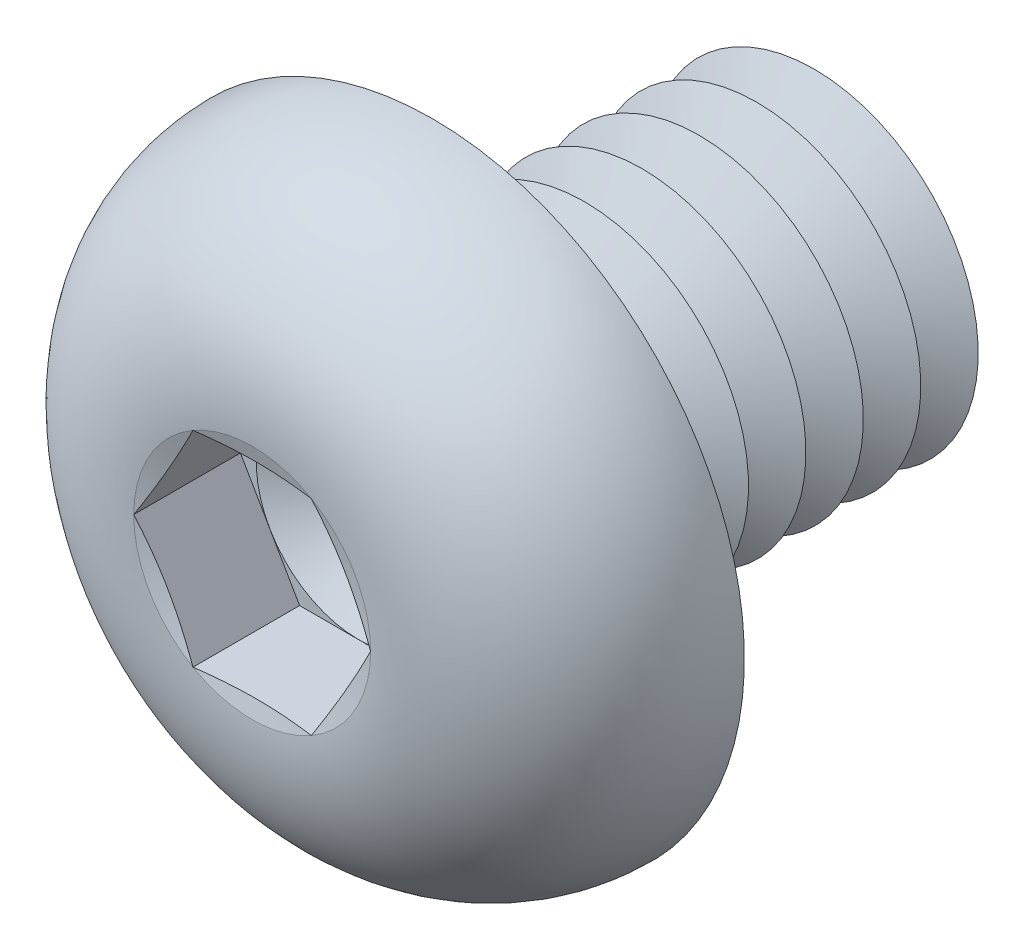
ISO-10303-21;
HEADER;
FILE_DESCRIPTION(('STEP AP214'),'2;1');
FILE_NAME('part.step','',(''),(''),'','','');
FILE_SCHEMA(('AUTOMOTIVE_DESIGN { 1 0 10303 214 1 1 1 1 }'));
ENDSEC;
DATA;
#1=APPLICATION_CONTEXT('core data for automotive mechanical design processes');
#2=APPLICATION_PROTOCOL_DEFINITION('international standard','automotive_design',2000,#1);
#3=PRODUCT_CONTEXT('',#1,'mechanical');
#4=PRODUCT('Part','Part','',(#3));
#5=PRODUCT_RELATED_PRODUCT_CATEGORY('part','',(#4));
#6=PRODUCT_DEFINITION_FORMATION('','',#4);
#7=PRODUCT_DEFINITION_CONTEXT('part definition',#1,'design');
#8=PRODUCT_DEFINITION('design','',#6,#7);
#9=PRODUCT_DEFINITION_SHAPE('','',#8);
#10=(LENGTH_UNIT() NAMED_UNIT(*) SI_UNIT(.MILLI.,.METRE.));
#11=(NAMED_UNIT(*) PLANE_ANGLE_UNIT() SI_UNIT($,.RADIAN.));
#12=(NAMED_UNIT(*) SI_UNIT($,.STERADIAN.) SOLID_ANGLE_UNIT());
#13=UNCERTAINTY_MEASURE_WITH_UNIT(LENGTH_MEASURE(1.E-05),#10,'distance_accuracy_value','');
#14=(GEOMETRIC_REPRESENTATION_CONTEXT(3) GLOBAL_UNCERTAINTY_ASSIGNED_CONTEXT((#13)) GLOBAL_UNIT_ASSIGNED_CONTEXT((#10,
#11,#12)) REPRESENTATION_CONTEXT('',''));
#15=CARTESIAN_POINT('',(0.,0.,0.));
#16=DIRECTION('',(0.,0.,1.));
#17=DIRECTION('',(1.,0.,0.));
#18=AXIS2_PLACEMENT_3D('',#15,#16,#17);
#19=CARTESIAN_POINT('',(0.,0.,0.9));
#20=DIRECTION('',(0.,0.,1.));
#21=DIRECTION('',(1.,0.,0.));
#22=AXIS2_PLACEMENT_3D('',#19,#20,#21);
#23=PLANE('',#22);
#24=CARTESIAN_POINT('',(0.,0.,0.9));
#25=DIRECTION('',(0.,0.,1.));
#26=DIRECTION('',(1.,0.,0.));
#27=AXIS2_PLACEMENT_3D('',#24,#25,#26);
#28=CIRCLE('',#27,1.24999941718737);
#29=CARTESIAN_POINT('',(1.08253125,0.624999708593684,0.9));
#30=VERTEX_POINT('',#29);
#31=CARTESIAN_POINT('',(0.,1.24999941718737,0.9));
#32=VERTEX_POINT('',#31);
#33=EDGE_CURVE('E118',#30,#32,#28,.T.);
#34=ORIENTED_EDGE('',*,*,#33,.F.);
#35=DIRECTION('',(-0.5,0.866025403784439,0.));
#36=VECTOR('',#35,1.);
#37=CARTESIAN_POINT('',(1.44337500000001,0.,0.9));
#38=LINE('',#37,#36);
#39=CARTESIAN_POINT('',(0.721687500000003,1.24999941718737,0.9));
#40=VERTEX_POINT('',#39);
#41=EDGE_CURVE('E125',#30,#40,#38,.T.);
#42=ORIENTED_EDGE('',*,*,#41,.T.);
#43=DIRECTION('',(-1.,0.,0.));
#44=VECTOR('',#43,1.);
#45=CARTESIAN_POINT('',(0.721687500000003,1.24999941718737,0.9));
#46=LINE('',#45,#44);
#47=EDGE_CURVE('E136',#40,#32,#46,.T.);
#48=ORIENTED_EDGE('',*,*,#47,.T.);
#49=EDGE_LOOP('',(#34,#42,#48));
#50=FACE_BOUND('',#49,.T.);
#51=ADVANCED_FACE('F39',(#50),#23,.T.);
#52=CARTESIAN_POINT('',(0.,0.,0.9));
#53=DIRECTION('',(0.,0.,1.));
#54=DIRECTION('',(1.,0.,0.));
#55=AXIS2_PLACEMENT_3D('',#52,#53,#54);
#56=CIRCLE('',#55,1.24999941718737);
#57=CARTESIAN_POINT('',(-1.08253125,0.624999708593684,0.9));
#58=VERTEX_POINT('',#57);
#59=EDGE_CURVE('E11',#32,#58,#56,.T.);
#60=ORIENTED_EDGE('',*,*,#59,.F.);
#61=CARTESIAN_POINT('',(-0.721687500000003,1.24999941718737,0.9));
#62=VERTEX_POINT('',#61);
#63=EDGE_CURVE('E131',#32,#62,#46,.T.);
#64=ORIENTED_EDGE('',*,*,#63,.T.);
#65=DIRECTION('',(-0.5,-0.866025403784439,0.));
#66=VECTOR('',#65,1.);
#67=CARTESIAN_POINT('',(-0.721687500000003,1.24999941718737,0.9));
#68=LINE('',#67,#66);
#69=EDGE_CURVE('E134',#62,#58,#68,.T.);
#70=ORIENTED_EDGE('',*,*,#69,.T.);
#71=EDGE_LOOP('',(#60,#64,#70));
#72=FACE_BOUND('',#71,.T.);
#73=ADVANCED_FACE('F130',(#72),#23,.T.);
#74=CARTESIAN_POINT('',(-1.08253125,-0.624999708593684,0.9));
#75=VERTEX_POINT('',#74);
#76=EDGE_CURVE('E49',#58,#75,#56,.T.);
#77=ORIENTED_EDGE('',*,*,#76,.F.);
#78=CARTESIAN_POINT('',(-1.44337500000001,0.,0.9));
#79=VERTEX_POINT('',#78);
#80=EDGE_CURVE('E143',#58,#79,#68,.T.);
#81=ORIENTED_EDGE('',*,*,#80,.T.);
#82=DIRECTION('',(0.5,-0.866025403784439,0.));
#83=VECTOR('',#82,1.);
#84=CARTESIAN_POINT('',(-1.44337500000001,0.,0.9));
#85=LINE('',#84,#83);
#86=EDGE_CURVE('E152',#79,#75,#85,.T.);
#87=ORIENTED_EDGE('',*,*,#86,.T.);
#88=EDGE_LOOP('',(#77,#81,#87));
#89=FACE_BOUND('',#88,.T.);
#90=ADVANCED_FACE('F329',(#89),#23,.T.);
#91=CARTESIAN_POINT('',(0.,-1.24999941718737,0.9));
#92=VERTEX_POINT('',#91);
#93=EDGE_CURVE('E314',#75,#92,#56,.T.);
#94=ORIENTED_EDGE('',*,*,#93,.F.);
#95=CARTESIAN_POINT('',(-0.721687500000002,-1.24999941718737,0.9));
#96=VERTEX_POINT('',#95);
#97=EDGE_CURVE('E151',#75,#96,#85,.T.);
#98=ORIENTED_EDGE('',*,*,#97,.T.);
#99=DIRECTION('',(1.,0.,0.));
#100=VECTOR('',#99,1.);
#101=CARTESIAN_POINT('',(-0.721687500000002,-1.24999941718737,0.9));
#102=LINE('',#101,#100);
#103=EDGE_CURVE('E157',#96,#92,#102,.T.);
#104=ORIENTED_EDGE('',*,*,#103,.T.);
#105=EDGE_LOOP('',(#94,#98,#104));
#106=FACE_BOUND('',#105,.T.);
#107=ADVANCED_FACE('F322',(#106),#23,.T.);
#108=CARTESIAN_POINT('',(1.08253125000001,-0.624999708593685,0.9));
#109=VERTEX_POINT('',#108);
#110=EDGE_CURVE('E56',#92,#109,#56,.T.);
#111=ORIENTED_EDGE('',*,*,#110,.F.);
#112=CARTESIAN_POINT('',(0.721687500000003,-1.24999941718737,0.9));
#113=VERTEX_POINT('',#112);
#114=EDGE_CURVE('E156',#92,#113,#102,.T.);
#115=ORIENTED_EDGE('',*,*,#114,.T.);
#116=DIRECTION('',(0.5,0.866025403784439,0.));
#117=VECTOR('',#116,1.);
#118=CARTESIAN_POINT('',(0.721687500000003,-1.24999941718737,0.9));
#119=LINE('',#118,#117);
#120=EDGE_CURVE('E162',#113,#109,#119,.T.);
#121=ORIENTED_EDGE('',*,*,#120,.T.);
#122=EDGE_LOOP('',(#111,#115,#121));
#123=FACE_BOUND('',#122,.T.);
#124=ADVANCED_FACE('F400',(#123),#23,.T.);
#125=CARTESIAN_POINT('',(0.,0.,2.2));
#126=DIRECTION('',(0.,0.,1.));
#127=DIRECTION('',(0.,-1.,0.));
#128=AXIS2_PLACEMENT_3D('',#125,#126,#127);
#129=CONICAL_SURFACE('',#128,1.44337500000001,1.30899693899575);
#130=CARTESIAN_POINT('',(1.44349047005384,-0.000200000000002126,2.20003094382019));
#131=CARTESIAN_POINT('',(1.41351104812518,0.0517258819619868,2.19199301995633));
#132=CARTESIAN_POINT('',(1.38347725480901,0.103745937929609,2.18469579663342));
#133=CARTESIAN_POINT('',(1.32330355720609,0.20796983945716,2.17187512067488));
#134=CARTESIAN_POINT('',(1.29316361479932,0.260173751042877,2.16635238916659));
#135=CARTESIAN_POINT('',(1.23296043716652,0.364448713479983,2.15740323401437));
#136=CARTESIAN_POINT('',(1.20289760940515,0.416519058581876,2.15396613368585));
#137=CARTESIAN_POINT('',(1.14273359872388,0.520726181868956,2.14935732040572));
#138=CARTESIAN_POINT('',(1.11263242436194,0.572862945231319,2.14818516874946));
#139=CARTESIAN_POINT('',(1.05243007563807,0.677136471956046,2.14818516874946));
#140=CARTESIAN_POINT('',(1.02232890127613,0.729273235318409,2.14935732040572));
#141=CARTESIAN_POINT('',(0.96216489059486,0.833480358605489,2.15396613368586));
#142=CARTESIAN_POINT('',(0.932102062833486,0.885550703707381,2.15740323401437));
#143=CARTESIAN_POINT('',(0.871898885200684,0.989825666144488,2.16635238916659));
#144=CARTESIAN_POINT('',(0.841758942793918,1.04202957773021,2.17187512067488));
#145=CARTESIAN_POINT('',(0.781585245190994,1.14625347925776,2.18469579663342));
#146=CARTESIAN_POINT('',(0.751551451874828,1.19827353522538,2.19199301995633));
#147=CARTESIAN_POINT('',(0.721572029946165,1.25019941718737,2.20003094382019));
#148=B_SPLINE_CURVE_WITH_KNOTS('',3,(#130,#131,#132,#133,#134,#135,#136,#137,#138,#139,#140,
#141,#142,#143,#144,#145,#146,#147),.UNSPECIFIED.,.F.,.F.,(4,2,2,2,2,2,2,2,4),(0.,
0.181495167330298,0.363063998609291,0.543695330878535,0.724291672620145,0.904888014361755,
1.085519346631,1.26708817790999,1.44858334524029),.UNSPECIFIED.);
#149=CARTESIAN_POINT('',(1.44337500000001,0.,2.2));
#150=VERTEX_POINT('',#149);
#151=CARTESIAN_POINT('',(0.721687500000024,1.24999941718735,2.2));
#152=VERTEX_POINT('',#151);
#153=EDGE_CURVE('E222',#150,#152,#148,.T.);
#154=ORIENTED_EDGE('',*,*,#153,.F.);
#155=CARTESIAN_POINT('',(0.,0.,2.2));
#156=DIRECTION('',(0.,0.,-1.));
#157=DIRECTION('',(0.,1.,0.));
#158=AXIS2_PLACEMENT_3D('',#155,#156,#157);
#159=CIRCLE('',#158,1.44337500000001);
#160=EDGE_CURVE('E294',#152,#150,#159,.T.);
#161=ORIENTED_EDGE('',*,*,#160,.F.);
#162=EDGE_LOOP('',(#154,#161));
#163=FACE_BOUND('',#162,.T.);
#164=ADVANCED_FACE('F404',(#163),#129,.F.);
#165=CARTESIAN_POINT('',(0.721572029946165,-1.25019941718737,2.20003094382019));
#166=CARTESIAN_POINT('',(0.751551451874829,-1.19827353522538,2.19199301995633));
#167=CARTESIAN_POINT('',(0.781585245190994,-1.14625347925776,2.18469579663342));
#168=CARTESIAN_POINT('',(0.841758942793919,-1.04202957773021,2.17187512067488));
#169=CARTESIAN_POINT('',(0.871898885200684,-0.989825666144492,2.16635238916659));
#170=CARTESIAN_POINT('',(0.932102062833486,-0.885550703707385,2.15740323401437));
#171=CARTESIAN_POINT('',(0.96216489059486,-0.833480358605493,2.15396613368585));
#172=CARTESIAN_POINT('',(1.02232890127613,-0.729273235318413,2.14935732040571));
#173=CARTESIAN_POINT('',(1.05243007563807,-0.67713647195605,2.14818516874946));
#174=CARTESIAN_POINT('',(1.11263242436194,-0.572862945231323,2.14818516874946));
#175=CARTESIAN_POINT('',(1.14273359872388,-0.52072618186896,2.14935732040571));
#176=CARTESIAN_POINT('',(1.20289760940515,-0.41651905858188,2.15396613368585));
#177=CARTESIAN_POINT('',(1.23296043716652,-0.364448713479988,2.15740323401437));
#178=CARTESIAN_POINT('',(1.29316361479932,-0.260173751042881,2.16635238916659));
#179=CARTESIAN_POINT('',(1.32330355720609,-0.207969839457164,2.17187512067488));
#180=CARTESIAN_POINT('',(1.38347725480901,-0.103745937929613,2.18469579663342));
#181=CARTESIAN_POINT('',(1.41351104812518,-0.0517258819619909,2.19199301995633));
#182=CARTESIAN_POINT('',(1.44349047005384,0.000199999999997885,2.20003094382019));
#183=B_SPLINE_CURVE_WITH_KNOTS('',3,(#165,#166,#167,#168,#169,#170,#171,#172,#173,#174,#175,
#176,#177,#178,#179,#180,#181,#182),.UNSPECIFIED.,.F.,.F.,(4,2,2,2,2,2,2,2,4),(0.,
0.181495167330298,0.363063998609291,0.543695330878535,0.724291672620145,0.904888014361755,
1.085519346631,1.26708817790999,1.44858334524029),.UNSPECIFIED.);
#184=CARTESIAN_POINT('',(0.721687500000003,-1.24999941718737,2.2));
#185=VERTEX_POINT('',#184);
#186=EDGE_CURVE('E231',#185,#150,#183,.T.);
#187=ORIENTED_EDGE('',*,*,#186,.F.);
#188=EDGE_CURVE('E299',#150,#185,#159,.T.);
#189=ORIENTED_EDGE('',*,*,#188,.F.);
#190=EDGE_LOOP('',(#187,#189));
#191=FACE_BOUND('',#190,.T.);
#192=ADVANCED_FACE('F365',(#191),#129,.F.);
#193=CARTESIAN_POINT('',(-2.17815859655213,-1.24999941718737,2.48616275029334));
#194=CARTESIAN_POINT('',(-2.07269794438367,-1.24999941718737,2.46168811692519));
#195=CARTESIAN_POINT('',(-1.967149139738,-1.24999941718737,2.43756889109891));
#196=CARTESIAN_POINT('',(-1.75576352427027,-1.24999941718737,2.39052699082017));
#197=CARTESIAN_POINT('',(-1.64992665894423,-1.24999941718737,2.36760456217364));
#198=CARTESIAN_POINT('',(-1.43690237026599,-1.24999941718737,2.3232454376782));
#199=CARTESIAN_POINT('',(-1.32971158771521,-1.24999941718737,2.30182468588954));
#200=CARTESIAN_POINT('',(-1.1148274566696,-1.24999941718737,2.26156703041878));
#201=CARTESIAN_POINT('',(-1.00713406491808,-1.24999941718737,2.24273035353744));
#202=CARTESIAN_POINT('',(-0.794044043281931,-1.24999941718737,2.2093913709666));
#203=CARTESIAN_POINT('',(-0.688664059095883,-1.24999941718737,2.19478562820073));
#204=CARTESIAN_POINT('',(-0.477310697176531,-1.24999941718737,2.17085809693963));
#205=CARTESIAN_POINT('',(-0.371337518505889,-1.24999941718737,2.16153463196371));
#206=CARTESIAN_POINT('',(-0.159455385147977,-1.24999941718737,2.14976770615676));
#207=CARTESIAN_POINT('',(-0.0535482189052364,-1.24999941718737,2.14729400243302));
#208=CARTESIAN_POINT('',(0.15818919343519,-1.24999941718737,2.14966287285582));
#209=CARTESIAN_POINT('',(0.264019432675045,-1.24999941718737,2.15450603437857));
#210=CARTESIAN_POINT('',(0.445148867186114,-1.24999941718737,2.16825380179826));
#211=CARTESIAN_POINT('',(0.520574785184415,-1.24999941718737,2.17561242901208));
#212=CARTESIAN_POINT('',(0.671115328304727,-1.24999941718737,2.19297000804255));
#213=CARTESIAN_POINT('',(0.746229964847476,-1.24999941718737,2.20296886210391));
#214=CARTESIAN_POINT('',(0.89638731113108,-1.24999941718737,2.22505910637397));
#215=CARTESIAN_POINT('',(0.97142904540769,-1.24999941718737,2.23715700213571));
#216=CARTESIAN_POINT('',(1.12124320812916,-1.24999941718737,2.26292371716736));
#217=CARTESIAN_POINT('',(1.19601562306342,-1.24999941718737,2.27659261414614));
#218=CARTESIAN_POINT('',(1.34686913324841,-1.24999941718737,2.30540811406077));
#219=CARTESIAN_POINT('',(1.42294548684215,-1.24999941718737,2.320579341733));
#220=CARTESIAN_POINT('',(1.57490676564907,-1.24999941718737,2.351851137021));
#221=CARTESIAN_POINT('',(1.65079168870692,-1.24999941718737,2.36795171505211));
#222=CARTESIAN_POINT('',(1.80199501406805,-1.24999941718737,2.40076814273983));
#223=CARTESIAN_POINT('',(1.8773142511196,-1.24999941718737,2.41748016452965));
#224=CARTESIAN_POINT('',(2.02782424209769,-1.24999941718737,2.45144971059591));
#225=CARTESIAN_POINT('',(2.10301500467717,-1.24999941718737,2.46870719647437));
#226=CARTESIAN_POINT('',(2.17815859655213,-1.24999941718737,2.48616275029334));
#227=B_SPLINE_CURVE_WITH_KNOTS('',3,(#193,#194,#195,#196,#197,#198,#199,#200,#201,#202,#203,
#204,#205,#206,#207,#208,#209,#210,#211,#212,#213,#214,#215,#216,#217,#218,#219,#220,#221,#222,
#223,#224,#225,#226),.UNSPECIFIED.,.F.,.F.,(4,2,2,2,2,2,2,2,2,2,2,2,2,2,2,2,4),(0.,
0.324797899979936,0.649662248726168,0.977572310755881,1.30551113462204,1.62458166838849,
1.94355087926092,2.26110952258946,2.5786936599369,2.80599541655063,3.03328875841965,
3.26129956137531,3.48932164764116,3.72203713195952,3.954755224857,4.18620606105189,
4.41764064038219),.UNSPECIFIED.);
#228=CARTESIAN_POINT('',(-0.721687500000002,-1.24999941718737,2.2));
#229=VERTEX_POINT('',#228);
#230=EDGE_CURVE('E342',#229,#185,#227,.T.);
#231=ORIENTED_EDGE('',*,*,#230,.F.);
#232=EDGE_CURVE('E355',#185,#229,#159,.T.);
#233=ORIENTED_EDGE('',*,*,#232,.F.);
#234=EDGE_LOOP('',(#231,#233));
#235=FACE_BOUND('',#234,.T.);
#236=ADVANCED_FACE('F370',(#235),#129,.F.);
#237=CARTESIAN_POINT('',(-1.44349047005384,0.000199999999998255,2.20003094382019));
#238=CARTESIAN_POINT('',(-1.41351104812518,-0.0517258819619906,2.19199301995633));
#239=CARTESIAN_POINT('',(-1.38347725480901,-0.103745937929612,2.18469579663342));
#240=CARTESIAN_POINT('',(-1.32330355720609,-0.207969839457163,2.17187512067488));
#241=CARTESIAN_POINT('',(-1.29316361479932,-0.260173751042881,2.16635238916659));
#242=CARTESIAN_POINT('',(-1.23296043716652,-0.364448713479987,2.15740323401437));
#243=CARTESIAN_POINT('',(-1.20289760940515,-0.41651905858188,2.15396613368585));
#244=CARTESIAN_POINT('',(-1.14273359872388,-0.52072618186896,2.14935732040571));
#245=CARTESIAN_POINT('',(-1.11263242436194,-0.572862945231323,2.14818516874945));
#246=CARTESIAN_POINT('',(-1.05243007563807,-0.67713647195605,2.14818516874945));
#247=CARTESIAN_POINT('',(-1.02232890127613,-0.729273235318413,2.14935732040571));
#248=CARTESIAN_POINT('',(-0.962164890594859,-0.833480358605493,2.15396613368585));
#249=CARTESIAN_POINT('',(-0.932102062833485,-0.885550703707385,2.15740323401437));
#250=CARTESIAN_POINT('',(-0.871898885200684,-0.989825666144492,2.16635238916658));
#251=CARTESIAN_POINT('',(-0.841758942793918,-1.04202957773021,2.17187512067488));
#252=CARTESIAN_POINT('',(-0.781585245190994,-1.14625347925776,2.18469579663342));
#253=CARTESIAN_POINT('',(-0.751551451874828,-1.19827353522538,2.19199301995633));
#254=CARTESIAN_POINT('',(-0.721572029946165,-1.25019941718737,2.20003094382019));
#255=B_SPLINE_CURVE_WITH_KNOTS('',3,(#237,#238,#239,#240,#241,#242,#243,#244,#245,#246,#247,
#248,#249,#250,#251,#252,#253,#254),.UNSPECIFIED.,.F.,.F.,(4,2,2,2,2,2,2,2,4),(0.,
0.181495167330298,0.363063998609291,0.543695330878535,0.724291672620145,0.904888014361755,
1.085519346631,1.26708817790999,1.44858334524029),.UNSPECIFIED.);
#256=CARTESIAN_POINT('',(-1.44337500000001,0.,2.2));
#257=VERTEX_POINT('',#256);
#258=EDGE_CURVE('E334',#257,#229,#255,.T.);
#259=ORIENTED_EDGE('',*,*,#258,.F.);
#260=EDGE_CURVE('E340',#229,#257,#159,.T.);
#261=ORIENTED_EDGE('',*,*,#260,.F.);
#262=EDGE_LOOP('',(#259,#261));
#263=FACE_BOUND('',#262,.T.);
#264=ADVANCED_FACE('F338',(#263),#129,.F.);
#265=CARTESIAN_POINT('',(-0.721572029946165,1.25019941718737,2.20003094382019));
#266=CARTESIAN_POINT('',(-0.751551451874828,1.19827353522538,2.19199301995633));
#267=CARTESIAN_POINT('',(-0.781585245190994,1.14625347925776,2.18469579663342));
#268=CARTESIAN_POINT('',(-0.841758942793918,1.04202957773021,2.17187512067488));
#269=CARTESIAN_POINT('',(-0.871898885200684,0.989825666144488,2.16635238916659));
#270=CARTESIAN_POINT('',(-0.932102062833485,0.885550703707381,2.15740323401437));
#271=CARTESIAN_POINT('',(-0.962164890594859,0.833480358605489,2.15396613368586));
#272=CARTESIAN_POINT('',(-1.02232890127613,0.729273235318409,2.14935732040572));
#273=CARTESIAN_POINT('',(-1.05243007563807,0.677136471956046,2.14818516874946));
#274=CARTESIAN_POINT('',(-1.11263242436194,0.57286294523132,2.14818516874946));
#275=CARTESIAN_POINT('',(-1.14273359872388,0.520726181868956,2.14935732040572));
#276=CARTESIAN_POINT('',(-1.20289760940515,0.416519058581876,2.15396613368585));
#277=CARTESIAN_POINT('',(-1.23296043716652,0.364448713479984,2.15740323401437));
#278=CARTESIAN_POINT('',(-1.29316361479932,0.260173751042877,2.16635238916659));
#279=CARTESIAN_POINT('',(-1.32330355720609,0.20796983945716,2.17187512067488));
#280=CARTESIAN_POINT('',(-1.38347725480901,0.103745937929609,2.18469579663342));
#281=CARTESIAN_POINT('',(-1.41351104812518,0.0517258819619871,2.19199301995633));
#282=CARTESIAN_POINT('',(-1.44349047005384,-0.000200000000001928,2.20003094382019));
#283=B_SPLINE_CURVE_WITH_KNOTS('',3,(#265,#266,#267,#268,#269,#270,#271,#272,#273,#274,#275,
#276,#277,#278,#279,#280,#281,#282),.UNSPECIFIED.,.F.,.F.,(4,2,2,2,2,2,2,2,4),(0.,
0.181495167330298,0.363063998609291,0.543695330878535,0.724291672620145,0.904888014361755,
1.085519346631,1.26708817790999,1.44858334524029),.UNSPECIFIED.);
#284=CARTESIAN_POINT('',(-0.721687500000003,1.24999941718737,2.2));
#285=VERTEX_POINT('',#284);
#286=EDGE_CURVE('E195',#285,#257,#283,.T.);
#287=ORIENTED_EDGE('',*,*,#286,.F.);
#288=EDGE_CURVE('E345',#257,#285,#159,.T.);
#289=ORIENTED_EDGE('',*,*,#288,.F.);
#290=EDGE_LOOP('',(#287,#289));
#291=FACE_BOUND('',#290,.T.);
#292=ADVANCED_FACE('F346',(#291),#129,.F.);
#293=CARTESIAN_POINT('',(0.,0.,-2.55));
#294=DIRECTION('',(0.,0.,1.));
#295=DIRECTION('',(0.,-1.,0.));
#296=AXIS2_PLACEMENT_3D('',#293,#294,#295);
#297=CONICAL_SURFACE('',#296,2.,1.0471975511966);
#298=CARTESIAN_POINT('',(0.,0.,-2.9));
#299=DIRECTION('',(0.,0.,1.));
#300=DIRECTION('',(0.,-1.,0.));
#301=AXIS2_PLACEMENT_3D('',#298,#299,#300);
#302=CIRCLE('',#301,1.39378221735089);
#303=CARTESIAN_POINT('',(0.,-1.39378221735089,-2.9));
#304=VERTEX_POINT('',#303);
#305=EDGE_CURVE('E265',#304,#304,#302,.T.);
#306=ORIENTED_EDGE('',*,*,#305,.T.);
#307=EDGE_LOOP('',(#306));
#308=FACE_BOUND('',#307,.T.);
#309=CARTESIAN_POINT('',(0.,0.,-2.55));
#310=DIRECTION('',(0.,0.,1.));
#311=DIRECTION('',(0.,-1.,0.));
#312=AXIS2_PLACEMENT_3D('',#309,#310,#311);
#313=CIRCLE('',#312,2.);
#314=CARTESIAN_POINT('',(0.,-2.,-2.55));
#315=VERTEX_POINT('',#314);
#316=EDGE_CURVE('E261',#315,#315,#313,.T.);
#317=ORIENTED_EDGE('',*,*,#316,.F.);
#318=EDGE_LOOP('',(#317));
#319=FACE_BOUND('',#318,.T.);
#320=ADVANCED_FACE('F430',(#308,#319),#297,.T.);
#321=CARTESIAN_POINT('',(0.,0.,-2.9));
#322=DIRECTION('',(0.,0.,-1.));
#323=DIRECTION('',(0.,1.,0.));
#324=AXIS2_PLACEMENT_3D('',#321,#322,#323);
#325=CONICAL_SURFACE('',#324,1.39378221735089,1.04719755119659);
#326=CARTESIAN_POINT('',(0.,0.,-3.25));
#327=DIRECTION('',(0.,0.,1.));
#328=DIRECTION('',(0.,-1.,0.));
#329=AXIS2_PLACEMENT_3D('',#326,#327,#328);
#330=CIRCLE('',#329,2.);
#331=CARTESIAN_POINT('',(0.,-2.,-3.25));
#332=VERTEX_POINT('',#331);
#333=EDGE_CURVE('E269',#332,#332,#330,.T.);
#334=ORIENTED_EDGE('',*,*,#333,.T.);
#335=EDGE_LOOP('',(#334));
#336=FACE_BOUND('',#335,.T.);
#337=ORIENTED_EDGE('',*,*,#305,.F.);
#338=EDGE_LOOP('',(#337));
#339=FACE_BOUND('',#338,.T.);
#340=ADVANCED_FACE('F435',(#336,#339),#325,.T.);
#341=CARTESIAN_POINT('',(0.,2.,-5.));
#342=DIRECTION('',(0.,0.,-1.));
#343=DIRECTION('',(0.,1.,0.));
#344=AXIS2_PLACEMENT_3D('',#341,#342,#343);
#345=PLANE('',#344);
#346=CARTESIAN_POINT('',(0.,0.,-5.));
#347=DIRECTION('',(0.,0.,1.));
#348=DIRECTION('',(0.,-1.,0.));
#349=AXIS2_PLACEMENT_3D('',#346,#347,#348);
#350=CIRCLE('',#349,1.39378221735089);
#351=CARTESIAN_POINT('',(0.,-1.39378221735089,-5.));
#352=VERTEX_POINT('',#351);
#353=EDGE_CURVE('E289',#352,#352,#350,.T.);
#354=ORIENTED_EDGE('',*,*,#353,.F.);
#355=EDGE_LOOP('',(#354));
#356=FACE_BOUND('',#355,.T.);
#357=ADVANCED_FACE('F610',(#356),#345,.T.);
#358=CARTESIAN_POINT('',(0.,0.,-4.65));
#359=DIRECTION('',(0.,0.,1.));
#360=DIRECTION('',(0.,-1.,0.));
#361=AXIS2_PLACEMENT_3D('',#358,#359,#360);
#362=CONICAL_SURFACE('',#361,2.,1.0471975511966);
#363=ORIENTED_EDGE('',*,*,#353,.T.);
#364=EDGE_LOOP('',(#363));
#365=FACE_BOUND('',#364,.T.);
#366=CARTESIAN_POINT('',(0.,0.,-4.65));
#367=DIRECTION('',(0.,0.,1.));
#368=DIRECTION('',(0.,-1.,0.));
#369=AXIS2_PLACEMENT_3D('',#366,#367,#368);
#370=CIRCLE('',#369,2.);
#371=CARTESIAN_POINT('',(0.,-2.,-4.65));
#372=VERTEX_POINT('',#371);
#373=EDGE_CURVE('E285',#372,#372,#370,.T.);
#374=ORIENTED_EDGE('',*,*,#373,.F.);
#375=EDGE_LOOP('',(#374));
#376=FACE_BOUND('',#375,.T.);
#377=ADVANCED_FACE('F603',(#365,#376),#362,.T.);
#378=CARTESIAN_POINT('',(0.,0.,-4.3));
#379=DIRECTION('',(0.,0.,-1.));
#380=DIRECTION('',(0.,1.,0.));
#381=AXIS2_PLACEMENT_3D('',#378,#379,#380);
#382=CONICAL_SURFACE('',#381,1.39378221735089,1.04719755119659);
#383=ORIENTED_EDGE('',*,*,#373,.T.);
#384=EDGE_LOOP('',(#383));
#385=FACE_BOUND('',#384,.T.);
#386=CARTESIAN_POINT('',(0.,0.,-4.3));
#387=DIRECTION('',(0.,0.,1.));
#388=DIRECTION('',(0.,-1.,0.));
#389=AXIS2_PLACEMENT_3D('',#386,#387,#388);
#390=CIRCLE('',#389,1.39378221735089);
#391=CARTESIAN_POINT('',(0.,-1.39378221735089,-4.3));
#392=VERTEX_POINT('',#391);
#393=EDGE_CURVE('E281',#392,#392,#390,.T.);
#394=ORIENTED_EDGE('',*,*,#393,.F.);
#395=EDGE_LOOP('',(#394));
#396=FACE_BOUND('',#395,.T.);
#397=ADVANCED_FACE('F609',(#385,#396),#382,.T.);
#398=CARTESIAN_POINT('',(0.,0.,-3.95));
#399=DIRECTION('',(0.,0.,1.));
#400=DIRECTION('',(0.,-1.,0.));
#401=AXIS2_PLACEMENT_3D('',#398,#399,#400);
#402=CONICAL_SURFACE('',#401,2.,1.0471975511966);
#403=ORIENTED_EDGE('',*,*,#393,.T.);
#404=EDGE_LOOP('',(#403));
#405=FACE_BOUND('',#404,.T.);
#406=CARTESIAN_POINT('',(0.,0.,-3.95));
#407=DIRECTION('',(0.,0.,1.));
#408=DIRECTION('',(0.,-1.,0.));
#409=AXIS2_PLACEMENT_3D('',#406,#407,#408);
#410=CIRCLE('',#409,2.);
#411=CARTESIAN_POINT('',(0.,-2.,-3.95));
#412=VERTEX_POINT('',#411);
#413=EDGE_CURVE('E277',#412,#412,#410,.T.);
#414=ORIENTED_EDGE('',*,*,#413,.F.);
#415=EDGE_LOOP('',(#414));
#416=FACE_BOUND('',#415,.T.);
#417=ADVANCED_FACE('F641',(#405,#416),#402,.T.);
#418=CARTESIAN_POINT('',(0.,0.,-3.6));
#419=DIRECTION('',(0.,0.,-1.));
#420=DIRECTION('',(0.,1.,0.));
#421=AXIS2_PLACEMENT_3D('',#418,#419,#420);
#422=CONICAL_SURFACE('',#421,1.39378221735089,1.04719755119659);
#423=ORIENTED_EDGE('',*,*,#413,.T.);
#424=EDGE_LOOP('',(#423));
#425=FACE_BOUND('',#424,.T.);
#426=CARTESIAN_POINT('',(0.,0.,-3.6));
#427=DIRECTION('',(0.,0.,1.));
#428=DIRECTION('',(0.,-1.,0.));
#429=AXIS2_PLACEMENT_3D('',#426,#427,#428);
#430=CIRCLE('',#429,1.39378221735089);
#431=CARTESIAN_POINT('',(0.,-1.39378221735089,-3.6));
#432=VERTEX_POINT('',#431);
#433=EDGE_CURVE('E273',#432,#432,#430,.T.);
#434=ORIENTED_EDGE('',*,*,#433,.F.);
#435=EDGE_LOOP('',(#434));
#436=FACE_BOUND('',#435,.T.);
#437=ADVANCED_FACE('F651',(#425,#436),#422,.T.);
#438=CARTESIAN_POINT('',(0.,0.,-3.25));
#439=DIRECTION('',(0.,0.,1.));
#440=DIRECTION('',(0.,-1.,0.));
#441=AXIS2_PLACEMENT_3D('',#438,#439,#440);
#442=CONICAL_SURFACE('',#441,2.,1.0471975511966);
#443=ORIENTED_EDGE('',*,*,#433,.T.);
#444=EDGE_LOOP('',(#443));
#445=FACE_BOUND('',#444,.T.);
#446=ORIENTED_EDGE('',*,*,#333,.F.);
#447=EDGE_LOOP('',(#446));
#448=FACE_BOUND('',#447,.T.);
#449=ADVANCED_FACE('F661',(#445,#448),#442,.T.);
#450=CARTESIAN_POINT('',(0.,0.,-1.85));
#451=DIRECTION('',(0.,0.,1.));
#452=DIRECTION('',(0.,-1.,0.));
#453=AXIS2_PLACEMENT_3D('',#450,#451,#452);
#454=CONICAL_SURFACE('',#453,2.,1.0471975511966);
#455=CARTESIAN_POINT('',(0.,0.,-2.2));
#456=DIRECTION('',(0.,0.,1.));
#457=DIRECTION('',(0.,-1.,0.));
#458=AXIS2_PLACEMENT_3D('',#455,#456,#457);
#459=CIRCLE('',#458,1.39378221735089);
#460=CARTESIAN_POINT('',(0.,-1.39378221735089,-2.2));
#461=VERTEX_POINT('',#460);
#462=EDGE_CURVE('E257',#461,#461,#459,.T.);
#463=ORIENTED_EDGE('',*,*,#462,.T.);
#464=EDGE_LOOP('',(#463));
#465=FACE_BOUND('',#464,.T.);
#466=CARTESIAN_POINT('',(0.,0.,-1.85));
#467=DIRECTION('',(0.,0.,1.));
#468=DIRECTION('',(0.,-1.,0.));
#469=AXIS2_PLACEMENT_3D('',#466,#467,#468);
#470=CIRCLE('',#469,2.);
#471=CARTESIAN_POINT('',(0.,-2.,-1.85));
#472=VERTEX_POINT('',#471);
#473=EDGE_CURVE('E253',#472,#472,#470,.T.);
#474=ORIENTED_EDGE('',*,*,#473,.F.);
#475=EDGE_LOOP('',(#474));
#476=FACE_BOUND('',#475,.T.);
#477=ADVANCED_FACE('F671',(#465,#476),#454,.T.);
#478=CARTESIAN_POINT('',(0.,0.,-2.2));
#479=DIRECTION('',(0.,0.,-1.));
#480=DIRECTION('',(0.,1.,0.));
#481=AXIS2_PLACEMENT_3D('',#478,#479,#480);
#482=CONICAL_SURFACE('',#481,1.39378221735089,1.04719755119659);
#483=ORIENTED_EDGE('',*,*,#316,.T.);
#484=EDGE_LOOP('',(#483));
#485=FACE_BOUND('',#484,.T.);
#486=ORIENTED_EDGE('',*,*,#462,.F.);
#487=EDGE_LOOP('',(#486));
#488=FACE_BOUND('',#487,.T.);
#489=ADVANCED_FACE('F681',(#485,#488),#482,.T.);
#490=CARTESIAN_POINT('',(0.,0.,-1.15));
#491=DIRECTION('',(0.,0.,1.));
#492=DIRECTION('',(0.,-1.,0.));
#493=AXIS2_PLACEMENT_3D('',#490,#491,#492);
#494=CONICAL_SURFACE('',#493,2.,1.0471975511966);
#495=CARTESIAN_POINT('',(0.,0.,-1.5));
#496=DIRECTION('',(0.,0.,1.));
#497=DIRECTION('',(0.,-1.,0.));
#498=AXIS2_PLACEMENT_3D('',#495,#496,#497);
#499=CIRCLE('',#498,1.39378221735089);
#500=CARTESIAN_POINT('',(0.,-1.39378221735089,-1.5));
#501=VERTEX_POINT('',#500);
#502=EDGE_CURVE('E249',#501,#501,#499,.T.);
#503=ORIENTED_EDGE('',*,*,#502,.T.);
#504=EDGE_LOOP('',(#503));
#505=FACE_BOUND('',#504,.T.);
#506=CARTESIAN_POINT('',(0.,0.,-1.15));
#507=DIRECTION('',(0.,0.,1.));
#508=DIRECTION('',(0.,-1.,0.));
#509=AXIS2_PLACEMENT_3D('',#506,#507,#508);
#510=CIRCLE('',#509,2.);
#511=CARTESIAN_POINT('',(0.,-2.,-1.15));
#512=VERTEX_POINT('',#511);
#513=EDGE_CURVE('E241',#512,#512,#510,.T.);
#514=ORIENTED_EDGE('',*,*,#513,.F.);
#515=EDGE_LOOP('',(#514));
#516=FACE_BOUND('',#515,.T.);
#517=ADVANCED_FACE('F691',(#505,#516),#494,.T.);
#518=CARTESIAN_POINT('',(0.,0.,-1.5));
#519=DIRECTION('',(0.,0.,-1.));
#520=DIRECTION('',(0.,1.,0.));
#521=AXIS2_PLACEMENT_3D('',#518,#519,#520);
#522=CONICAL_SURFACE('',#521,1.39378221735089,1.04719755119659);
#523=ORIENTED_EDGE('',*,*,#473,.T.);
#524=EDGE_LOOP('',(#523));
#525=FACE_BOUND('',#524,.T.);
#526=ORIENTED_EDGE('',*,*,#502,.F.);
#527=EDGE_LOOP('',(#526));
#528=FACE_BOUND('',#527,.T.);
#529=ADVANCED_FACE('F701',(#525,#528),#522,.T.);
#530=CARTESIAN_POINT('',(0.,0.,-0.450000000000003));
#531=DIRECTION('',(0.,0.,1.));
#532=DIRECTION('',(0.,-1.,0.));
#533=AXIS2_PLACEMENT_3D('',#530,#531,#532);
#534=CONICAL_SURFACE('',#533,2.,1.0471975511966);
#535=CARTESIAN_POINT('',(0.,0.,-0.799999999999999));
#536=DIRECTION('',(0.,0.,1.));
#537=DIRECTION('',(0.,-1.,0.));
#538=AXIS2_PLACEMENT_3D('',#535,#536,#537);
#539=CIRCLE('',#538,1.39378221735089);
#540=CARTESIAN_POINT('',(0.,-1.39378221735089,-0.799999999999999));
#541=VERTEX_POINT('',#540);
#542=EDGE_CURVE('E230',#541,#541,#539,.T.);
#543=ORIENTED_EDGE('',*,*,#542,.T.);
#544=EDGE_LOOP('',(#543));
#545=FACE_BOUND('',#544,.T.);
#546=CARTESIAN_POINT('',(0.,0.,-0.450000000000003));
#547=DIRECTION('',(0.,0.,1.));
#548=DIRECTION('',(0.,-1.,0.));
#549=AXIS2_PLACEMENT_3D('',#546,#547,#548);
#550=CIRCLE('',#549,2.);
#551=CARTESIAN_POINT('',(0.,-2.,-0.450000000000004));
#552=VERTEX_POINT('',#551);
#553=EDGE_CURVE('E245',#552,#552,#550,.T.);
#554=ORIENTED_EDGE('',*,*,#553,.F.);
#555=EDGE_LOOP('',(#554));
#556=FACE_BOUND('',#555,.T.);
#557=ADVANCED_FACE('F427',(#545,#556),#534,.T.);
#558=CARTESIAN_POINT('',(0.,0.,-0.799999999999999));
#559=DIRECTION('',(0.,0.,-1.));
#560=DIRECTION('',(0.,1.,0.));
#561=AXIS2_PLACEMENT_3D('',#558,#559,#560);
#562=CONICAL_SURFACE('',#561,1.39378221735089,1.04719755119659);
#563=ORIENTED_EDGE('',*,*,#513,.T.);
#564=EDGE_LOOP('',(#563));
#565=FACE_BOUND('',#564,.T.);
#566=ORIENTED_EDGE('',*,*,#542,.F.);
#567=EDGE_LOOP('',(#566));
#568=FACE_BOUND('',#567,.T.);
#569=ADVANCED_FACE('F219',(#565,#568),#562,.T.);
#570=CARTESIAN_POINT('',(2.17815859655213,1.24999941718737,2.48616275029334));
#571=CARTESIAN_POINT('',(2.07269794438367,1.24999941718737,2.4616881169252));
#572=CARTESIAN_POINT('',(1.967149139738,1.24999941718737,2.43756889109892));
#573=CARTESIAN_POINT('',(1.75576352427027,1.24999941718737,2.39052699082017));
#574=CARTESIAN_POINT('',(1.64992665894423,1.24999941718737,2.36760456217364));
#575=CARTESIAN_POINT('',(1.43690237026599,1.24999941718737,2.3232454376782));
#576=CARTESIAN_POINT('',(1.32971158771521,1.24999941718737,2.30182468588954));
#577=CARTESIAN_POINT('',(1.1148274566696,1.24999941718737,2.26156703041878));
#578=CARTESIAN_POINT('',(1.00713406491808,1.24999941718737,2.24273035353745));
#579=CARTESIAN_POINT('',(0.794044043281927,1.24999941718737,2.2093913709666));
#580=CARTESIAN_POINT('',(0.68866405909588,1.24999941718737,2.19478562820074));
#581=CARTESIAN_POINT('',(0.477310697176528,1.24999941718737,2.17085809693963));
#582=CARTESIAN_POINT('',(0.371337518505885,1.24999941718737,2.16153463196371));
#583=CARTESIAN_POINT('',(0.159455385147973,1.24999941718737,2.14976770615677));
#584=CARTESIAN_POINT('',(0.0535482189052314,1.24999941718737,2.14729400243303));
#585=CARTESIAN_POINT('',(-0.158189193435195,1.24999941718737,2.14966287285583));
#586=CARTESIAN_POINT('',(-0.26401943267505,1.24999941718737,2.15450603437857));
#587=CARTESIAN_POINT('',(-0.44514886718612,1.24999941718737,2.16825380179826));
#588=CARTESIAN_POINT('',(-0.52057478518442,1.24999941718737,2.17561242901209));
#589=CARTESIAN_POINT('',(-0.671115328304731,1.24999941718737,2.19297000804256));
#590=CARTESIAN_POINT('',(-0.74622996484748,1.24999941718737,2.20296886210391));
#591=CARTESIAN_POINT('',(-0.896387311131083,1.24999941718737,2.22505910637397));
#592=CARTESIAN_POINT('',(-0.971429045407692,1.24999941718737,2.23715700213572));
#593=CARTESIAN_POINT('',(-1.12124320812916,1.24999941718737,2.26292371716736));
#594=CARTESIAN_POINT('',(-1.19601562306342,1.24999941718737,2.27659261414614));
#595=CARTESIAN_POINT('',(-1.34686913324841,1.24999941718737,2.30540811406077));
#596=CARTESIAN_POINT('',(-1.42294548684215,1.24999941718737,2.32057934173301));
#597=CARTESIAN_POINT('',(-1.57490676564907,1.24999941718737,2.351851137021));
#598=CARTESIAN_POINT('',(-1.65079168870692,1.24999941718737,2.36795171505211));
#599=CARTESIAN_POINT('',(-1.80199501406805,1.24999941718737,2.40076814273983));
#600=CARTESIAN_POINT('',(-1.8773142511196,1.24999941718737,2.41748016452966));
#601=CARTESIAN_POINT('',(-2.02782424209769,1.24999941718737,2.45144971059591));
#602=CARTESIAN_POINT('',(-2.10301500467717,1.24999941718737,2.46870719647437));
#603=CARTESIAN_POINT('',(-2.17815859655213,1.24999941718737,2.48616275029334));
#604=B_SPLINE_CURVE_WITH_KNOTS('',3,(#570,#571,#572,#573,#574,#575,#576,#577,#578,#579,#580,
#581,#582,#583,#584,#585,#586,#587,#588,#589,#590,#591,#592,#593,#594,#595,#596,#597,#598,#599,
#600,#601,#602,#603),.UNSPECIFIED.,.F.,.F.,(4,2,2,2,2,2,2,2,2,2,2,2,2,2,2,2,4),(0.,
0.324797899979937,0.649662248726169,0.977572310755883,1.30551113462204,1.62458166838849,
1.94355087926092,2.26110952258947,2.57869365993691,2.80599541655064,3.03328875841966,
3.26129956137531,3.48932164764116,3.72203713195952,3.954755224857,4.18620606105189,
4.41764064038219),.UNSPECIFIED.);
#605=EDGE_CURVE('E170',#152,#285,#604,.T.);
#606=ORIENTED_EDGE('',*,*,#605,.F.);
#607=EDGE_CURVE('E293',#285,#152,#159,.T.);
#608=ORIENTED_EDGE('',*,*,#607,.F.);
#609=EDGE_LOOP('',(#606,#608));
#610=FACE_BOUND('',#609,.T.);
#611=ADVANCED_FACE('F202',(#610),#129,.F.);
#612=CARTESIAN_POINT('',(0.,0.,0.));
#613=DIRECTION('',(0.,0.,-1.));
#614=DIRECTION('',(0.,1.,0.));
#615=AXIS2_PLACEMENT_3D('',#612,#613,#614);
#616=DEGENERATE_TOROIDAL_SURFACE('',#615,1.59479522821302,2.20520477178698,.T.);
#617=ORIENTED_EDGE('',*,*,#160,.T.);
#618=ORIENTED_EDGE('',*,*,#188,.T.);
#619=ORIENTED_EDGE('',*,*,#232,.T.);
#620=ORIENTED_EDGE('',*,*,#260,.T.);
#621=ORIENTED_EDGE('',*,*,#288,.T.);
#622=ORIENTED_EDGE('',*,*,#607,.T.);
#623=EDGE_LOOP('',(#617,#618,#619,#620,#621,#622));
#624=FACE_BOUND('',#623,.T.);
#625=CARTESIAN_POINT('',(0.,0.,0.));
#626=DIRECTION('',(0.,0.,-1.));
#627=DIRECTION('',(0.,1.,0.));
#628=AXIS2_PLACEMENT_3D('',#625,#626,#627);
#629=CIRCLE('',#628,3.8);
#630=CARTESIAN_POINT('',(0.,3.79999999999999,0.));
#631=VERTEX_POINT('',#630);
#632=EDGE_CURVE('E298',#631,#631,#629,.T.);
#633=ORIENTED_EDGE('',*,*,#632,.F.);
#634=EDGE_LOOP('',(#633));
#635=FACE_BOUND('',#634,.T.);
#636=ADVANCED_FACE('F351',(#624,#635),#616,.T.);
#637=CARTESIAN_POINT('',(0.,1.99999999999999,0.));
#638=DIRECTION('',(0.,0.,-1.));
#639=DIRECTION('',(0.,1.,0.));
#640=AXIS2_PLACEMENT_3D('',#637,#638,#639);
#641=PLANE('',#640);
#642=CARTESIAN_POINT('',(0.,0.,0.));
#643=DIRECTION('',(0.,0.,-1.));
#644=DIRECTION('',(0.,1.,0.));
#645=AXIS2_PLACEMENT_3D('',#642,#643,#644);
#646=CIRCLE('',#645,2.35);
#647=CARTESIAN_POINT('',(0.,2.34999999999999,0.));
#648=VERTEX_POINT('',#647);
#649=EDGE_CURVE('E305',#648,#648,#646,.F.);
#650=ORIENTED_EDGE('',*,*,#649,.T.);
#651=EDGE_LOOP('',(#650));
#652=FACE_BOUND('',#651,.T.);
#653=ORIENTED_EDGE('',*,*,#632,.T.);
#654=EDGE_LOOP('',(#653));
#655=FACE_BOUND('',#654,.T.);
#656=ADVANCED_FACE('F426',(#652,#655),#641,.T.);
#657=CARTESIAN_POINT('',(0.,0.,-0.350000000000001));
#658=DIRECTION('',(0.,0.,-1.));
#659=DIRECTION('',(0.,1.,0.));
#660=AXIS2_PLACEMENT_3D('',#657,#658,#659);
#661=TOROIDAL_SURFACE('',#660,2.35,0.35);
#662=ORIENTED_EDGE('',*,*,#649,.F.);
#663=EDGE_LOOP('',(#662));
#664=FACE_BOUND('',#663,.T.);
#665=CARTESIAN_POINT('',(0.,0.,-0.350000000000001));
#666=DIRECTION('',(0.,0.,-1.));
#667=DIRECTION('',(0.,1.,0.));
#668=AXIS2_PLACEMENT_3D('',#665,#666,#667);
#669=CIRCLE('',#668,2.);
#670=CARTESIAN_POINT('',(0.,1.99999999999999,-0.35));
#671=VERTEX_POINT('',#670);
#672=EDGE_CURVE('E303',#671,#671,#669,.T.);
#673=ORIENTED_EDGE('',*,*,#672,.F.);
#674=EDGE_LOOP('',(#673));
#675=FACE_BOUND('',#674,.T.);
#676=ADVANCED_FACE('F41',(#664,#675),#661,.F.);
#677=CARTESIAN_POINT('',(0.,0.,-5.));
#678=DIRECTION('',(0.,0.,-1.));
#679=DIRECTION('',(0.,1.,0.));
#680=AXIS2_PLACEMENT_3D('',#677,#678,#679);
#681=CYLINDRICAL_SURFACE('',#680,2.);
#682=ORIENTED_EDGE('',*,*,#672,.T.);
#683=EDGE_LOOP('',(#682));
#684=FACE_BOUND('',#683,.T.);
#685=ORIENTED_EDGE('',*,*,#553,.T.);
#686=EDGE_LOOP('',(#685));
#687=FACE_BOUND('',#686,.T.);
#688=ADVANCED_FACE('F217',(#684,#687),#681,.T.);
#689=CARTESIAN_POINT('',(1.44337500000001,0.,0.9));
#690=DIRECTION('',(0.866025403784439,0.5,0.));
#691=DIRECTION('',(-0.5,0.866025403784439,0.));
#692=AXIS2_PLACEMENT_3D('',#689,#690,#691);
#693=PLANE('',#692);
#694=ORIENTED_EDGE('',*,*,#153,.T.);
#695=DIRECTION('',(0.,0.,1.));
#696=VECTOR('',#695,1.);
#697=CARTESIAN_POINT('',(0.721687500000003,1.24999941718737,0.9));
#698=LINE('',#697,#696);
#699=EDGE_CURVE('E64',#40,#152,#698,.T.);
#700=ORIENTED_EDGE('',*,*,#699,.F.);
#701=ORIENTED_EDGE('',*,*,#41,.F.);
#702=CARTESIAN_POINT('',(1.44337500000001,0.,0.9));
#703=VERTEX_POINT('',#702);
#704=EDGE_CURVE('E140',#703,#30,#38,.T.);
#705=ORIENTED_EDGE('',*,*,#704,.F.);
#706=DIRECTION('',(0.,0.,1.));
#707=VECTOR('',#706,1.);
#708=CARTESIAN_POINT('',(1.44337500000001,0.,0.9));
#709=LINE('',#708,#707);
#710=EDGE_CURVE('E166',#703,#150,#709,.T.);
#711=ORIENTED_EDGE('',*,*,#710,.T.);
#712=EDGE_LOOP('',(#694,#700,#701,#705,#711));
#713=FACE_BOUND('',#712,.T.);
#714=ADVANCED_FACE('F212',(#713),#693,.F.);
#715=CARTESIAN_POINT('',(0.721687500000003,-1.24999941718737,0.9));
#716=DIRECTION('',(0.866025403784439,-0.5,0.));
#717=DIRECTION('',(0.5,0.866025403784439,0.));
#718=AXIS2_PLACEMENT_3D('',#715,#716,#717);
#719=PLANE('',#718);
#720=ORIENTED_EDGE('',*,*,#186,.T.);
#721=ORIENTED_EDGE('',*,*,#710,.F.);
#722=EDGE_CURVE('E161',#109,#703,#119,.T.);
#723=ORIENTED_EDGE('',*,*,#722,.F.);
#724=ORIENTED_EDGE('',*,*,#120,.F.);
#725=DIRECTION('',(0.,0.,1.));
#726=VECTOR('',#725,1.);
#727=CARTESIAN_POINT('',(0.721687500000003,-1.24999941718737,0.9));
#728=LINE('',#727,#726);
#729=EDGE_CURVE('E171',#113,#185,#728,.T.);
#730=ORIENTED_EDGE('',*,*,#729,.T.);
#731=EDGE_LOOP('',(#720,#721,#723,#724,#730));
#732=FACE_BOUND('',#731,.T.);
#733=ADVANCED_FACE('F216',(#732),#719,.F.);
#734=CARTESIAN_POINT('',(-0.721687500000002,-1.24999941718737,0.9));
#735=DIRECTION('',(0.,-1.,0.));
#736=DIRECTION('',(0.,0.,-1.));
#737=AXIS2_PLACEMENT_3D('',#734,#735,#736);
#738=PLANE('',#737);
#739=ORIENTED_EDGE('',*,*,#230,.T.);
#740=ORIENTED_EDGE('',*,*,#729,.F.);
#741=ORIENTED_EDGE('',*,*,#114,.F.);
#742=ORIENTED_EDGE('',*,*,#103,.F.);
#743=DIRECTION('',(0.,0.,1.));
#744=VECTOR('',#743,1.);
#745=CARTESIAN_POINT('',(-0.721687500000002,-1.24999941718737,0.9));
#746=LINE('',#745,#744);
#747=EDGE_CURVE('E175',#96,#229,#746,.T.);
#748=ORIENTED_EDGE('',*,*,#747,.T.);
#749=EDGE_LOOP('',(#739,#740,#741,#742,#748));
#750=FACE_BOUND('',#749,.T.);
#751=ADVANCED_FACE('F384',(#750),#738,.F.);
#752=CARTESIAN_POINT('',(-1.44337500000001,0.,0.9));
#753=DIRECTION('',(-0.866025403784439,-0.5,0.));
#754=DIRECTION('',(0.5,-0.866025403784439,0.));
#755=AXIS2_PLACEMENT_3D('',#752,#753,#754);
#756=PLANE('',#755);
#757=ORIENTED_EDGE('',*,*,#258,.T.);
#758=ORIENTED_EDGE('',*,*,#747,.F.);
#759=ORIENTED_EDGE('',*,*,#97,.F.);
#760=ORIENTED_EDGE('',*,*,#86,.F.);
#761=DIRECTION('',(0.,0.,1.));
#762=VECTOR('',#761,1.);
#763=CARTESIAN_POINT('',(-1.44337500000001,0.,0.9));
#764=LINE('',#763,#762);
#765=EDGE_CURVE('E179',#79,#257,#764,.T.);
#766=ORIENTED_EDGE('',*,*,#765,.T.);
#767=EDGE_LOOP('',(#757,#758,#759,#760,#766));
#768=FACE_BOUND('',#767,.T.);
#769=ADVANCED_FACE('F327',(#768),#756,.F.);
#770=CARTESIAN_POINT('',(-0.721687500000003,1.24999941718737,0.9));
#771=DIRECTION('',(-0.866025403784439,0.5,0.));
#772=DIRECTION('',(-0.5,-0.866025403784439,0.));
#773=AXIS2_PLACEMENT_3D('',#770,#771,#772);
#774=PLANE('',#773);
#775=ORIENTED_EDGE('',*,*,#286,.T.);
#776=ORIENTED_EDGE('',*,*,#765,.F.);
#777=ORIENTED_EDGE('',*,*,#80,.F.);
#778=ORIENTED_EDGE('',*,*,#69,.F.);
#779=DIRECTION('',(0.,0.,1.));
#780=VECTOR('',#779,1.);
#781=CARTESIAN_POINT('',(-0.721687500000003,1.24999941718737,0.9));
#782=LINE('',#781,#780);
#783=EDGE_CURVE('E138',#62,#285,#782,.T.);
#784=ORIENTED_EDGE('',*,*,#783,.T.);
#785=EDGE_LOOP('',(#775,#776,#777,#778,#784));
#786=FACE_BOUND('',#785,.T.);
#787=ADVANCED_FACE('F209',(#786),#774,.F.);
#788=CARTESIAN_POINT('',(0.721687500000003,1.24999941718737,0.9));
#789=DIRECTION('',(0.,1.,0.));
#790=DIRECTION('',(0.,0.,1.));
#791=AXIS2_PLACEMENT_3D('',#788,#789,#790);
#792=PLANE('',#791);
#793=ORIENTED_EDGE('',*,*,#605,.T.);
#794=ORIENTED_EDGE('',*,*,#783,.F.);
#795=ORIENTED_EDGE('',*,*,#63,.F.);
#796=ORIENTED_EDGE('',*,*,#47,.F.);
#797=ORIENTED_EDGE('',*,*,#699,.T.);
#798=EDGE_LOOP('',(#793,#794,#795,#796,#797));
#799=FACE_BOUND('',#798,.T.);
#800=ADVANCED_FACE('F135',(#799),#792,.F.);
#801=EDGE_CURVE('E43',#109,#30,#56,.T.);
#802=ORIENTED_EDGE('',*,*,#801,.F.);
#803=ORIENTED_EDGE('',*,*,#722,.T.);
#804=ORIENTED_EDGE('',*,*,#704,.T.);
#805=EDGE_LOOP('',(#802,#803,#804));
#806=FACE_BOUND('',#805,.T.);
#807=ADVANCED_FACE('F115',(#806),#23,.T.);
#808=CARTESIAN_POINT('',(0.,0.,0.9));
#809=DIRECTION('',(0.,0.,1.));
#810=DIRECTION('',(1.,0.,0.));
#811=AXIS2_PLACEMENT_3D('',#808,#809,#810);
#812=CONICAL_SURFACE('',#811,1.24999941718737,1.0471975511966);
#813=CARTESIAN_POINT('',(0.,0.,0.178312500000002));
#814=VERTEX_POINT('',#813);
#815=VERTEX_LOOP('',#814);
#816=FACE_BOUND('',#815,.T.);
#817=ORIENTED_EDGE('',*,*,#33,.T.);
#818=ORIENTED_EDGE('',*,*,#59,.T.);
#819=ORIENTED_EDGE('',*,*,#76,.T.);
#820=ORIENTED_EDGE('',*,*,#93,.T.);
#821=ORIENTED_EDGE('',*,*,#110,.T.);
#822=ORIENTED_EDGE('',*,*,#801,.T.);
#823=EDGE_LOOP('',(#817,#818,#819,#820,#821,#822));
#824=FACE_BOUND('',#823,.T.);
#825=ADVANCED_FACE('F113',(#816,#824),#812,.F.);
#826=CLOSED_SHELL('',(#51,#73,#90,#107,#124,#164,#192,#236,#264,#292,#320,#340,#357,#377,#397,
#417,#437,#449,#477,#489,#517,#529,#557,#569,#611,#636,#656,#676,#688,#714,#733,#751,#769,#787,
#800,#807,#825));
#827=MANIFOLD_SOLID_BREP('B2',#826);
#828=ADVANCED_BREP_SHAPE_REPRESENTATION('',(#18,#827),#14);
#829=SHAPE_DEFINITION_REPRESENTATION(#9,#828);
ENDSEC;
END-ISO-10303-21;
